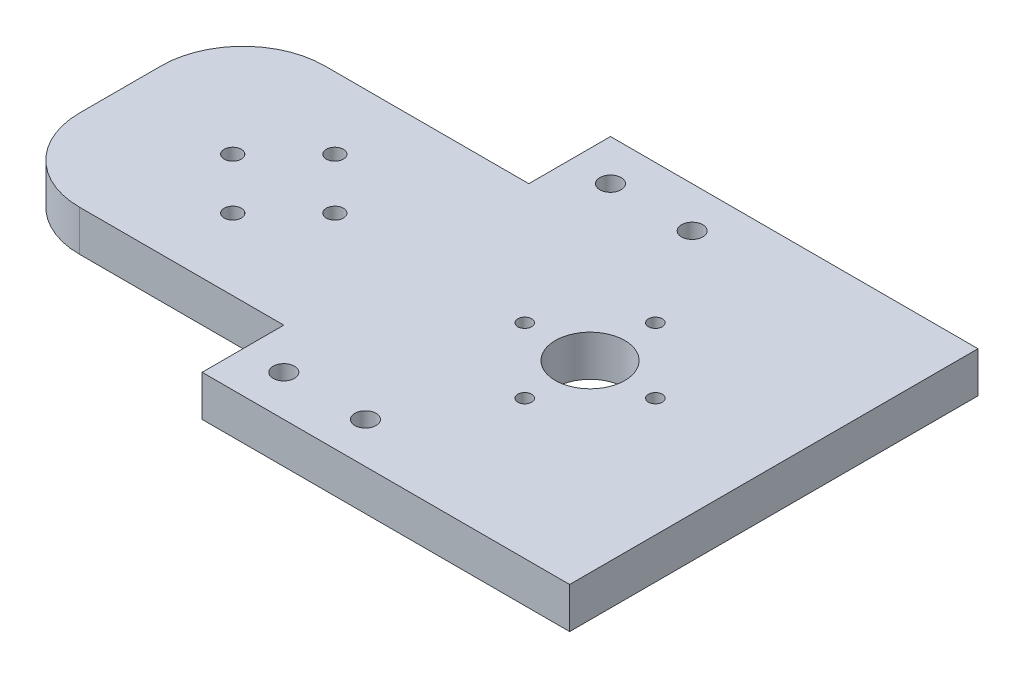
ISO-10303-21;
HEADER;
FILE_DESCRIPTION(('STEP AP214'),'2;1');
FILE_NAME('part.step','',(''),(''),'','','');
FILE_SCHEMA(('AUTOMOTIVE_DESIGN { 1 0 10303 214 1 1 1 1 }'));
ENDSEC;
DATA;
#1=APPLICATION_CONTEXT('core data for automotive mechanical design processes');
#2=APPLICATION_PROTOCOL_DEFINITION('international standard','automotive_design',2000,#1);
#3=PRODUCT_CONTEXT('',#1,'mechanical');
#4=PRODUCT('Part','Part','',(#3));
#5=PRODUCT_RELATED_PRODUCT_CATEGORY('part','',(#4));
#6=PRODUCT_DEFINITION_FORMATION('','',#4);
#7=PRODUCT_DEFINITION_CONTEXT('part definition',#1,'design');
#8=PRODUCT_DEFINITION('design','',#6,#7);
#9=PRODUCT_DEFINITION_SHAPE('','',#8);
#10=(LENGTH_UNIT() NAMED_UNIT(*) SI_UNIT(.MILLI.,.METRE.));
#11=(NAMED_UNIT(*) PLANE_ANGLE_UNIT() SI_UNIT($,.RADIAN.));
#12=(NAMED_UNIT(*) SI_UNIT($,.STERADIAN.) SOLID_ANGLE_UNIT());
#13=UNCERTAINTY_MEASURE_WITH_UNIT(LENGTH_MEASURE(1.E-05),#10,'distance_accuracy_value','');
#14=(GEOMETRIC_REPRESENTATION_CONTEXT(3) GLOBAL_UNCERTAINTY_ASSIGNED_CONTEXT((#13)) GLOBAL_UNIT_ASSIGNED_CONTEXT((#10,
#11,#12)) REPRESENTATION_CONTEXT('',''));
#15=CARTESIAN_POINT('',(0.,0.,0.));
#16=DIRECTION('',(0.,0.,1.));
#17=DIRECTION('',(1.,0.,0.));
#18=AXIS2_PLACEMENT_3D('',#15,#16,#17);
#19=CARTESIAN_POINT('',(-90.,10.,-50.));
#20=DIRECTION('',(0.,0.,1.));
#21=DIRECTION('',(1.,0.,0.));
#22=AXIS2_PLACEMENT_3D('',#19,#20,#21);
#23=PLANE('',#22);
#24=DIRECTION('',(-1.,0.,0.));
#25=VECTOR('',#24,1.);
#26=CARTESIAN_POINT('',(-90.,0.,-50.));
#27=LINE('',#26,#25);
#28=CARTESIAN_POINT('',(0.,0.,-50.));
#29=VERTEX_POINT('',#28);
#30=CARTESIAN_POINT('',(-90.,0.,-50.));
#31=VERTEX_POINT('',#30);
#32=EDGE_CURVE('E144',#29,#31,#27,.T.);
#33=ORIENTED_EDGE('',*,*,#32,.T.);
#34=DIRECTION('',(0.,-1.,0.));
#35=VECTOR('',#34,1.);
#36=CARTESIAN_POINT('',(-90.,10.,-50.));
#37=LINE('',#36,#35);
#38=CARTESIAN_POINT('',(-90.,10.,-50.));
#39=VERTEX_POINT('',#38);
#40=EDGE_CURVE('E127',#39,#31,#37,.T.);
#41=ORIENTED_EDGE('',*,*,#40,.F.);
#42=DIRECTION('',(-1.,0.,0.));
#43=VECTOR('',#42,1.);
#44=CARTESIAN_POINT('',(-90.,10.,-50.));
#45=LINE('',#44,#43);
#46=CARTESIAN_POINT('',(0.,10.,-50.));
#47=VERTEX_POINT('',#46);
#48=EDGE_CURVE('E135',#47,#39,#45,.T.);
#49=ORIENTED_EDGE('',*,*,#48,.F.);
#50=DIRECTION('',(0.,-1.,0.));
#51=VECTOR('',#50,1.);
#52=CARTESIAN_POINT('',(0.,10.,-50.));
#53=LINE('',#52,#51);
#54=EDGE_CURVE('E200',#47,#29,#53,.T.);
#55=ORIENTED_EDGE('',*,*,#54,.T.);
#56=EDGE_LOOP('',(#33,#41,#49,#55));
#57=FACE_BOUND('',#56,.T.);
#58=ADVANCED_FACE('F43',(#57),#23,.F.);
#59=CARTESIAN_POINT('',(-90.,10.,-30.));
#60=DIRECTION('',(1.,0.,0.));
#61=DIRECTION('',(0.,0.,-1.));
#62=AXIS2_PLACEMENT_3D('',#59,#60,#61);
#63=PLANE('',#62);
#64=DIRECTION('',(0.,0.,1.));
#65=VECTOR('',#64,1.);
#66=CARTESIAN_POINT('',(-90.,0.,-30.));
#67=LINE('',#66,#65);
#68=CARTESIAN_POINT('',(-90.,0.,-30.));
#69=VERTEX_POINT('',#68);
#70=EDGE_CURVE('E186',#31,#69,#67,.T.);
#71=ORIENTED_EDGE('',*,*,#70,.T.);
#72=DIRECTION('',(0.,-1.,0.));
#73=VECTOR('',#72,1.);
#74=CARTESIAN_POINT('',(-90.,10.,-30.));
#75=LINE('',#74,#73);
#76=CARTESIAN_POINT('',(-90.,10.,-30.));
#77=VERTEX_POINT('',#76);
#78=EDGE_CURVE('E129',#77,#69,#75,.T.);
#79=ORIENTED_EDGE('',*,*,#78,.F.);
#80=DIRECTION('',(0.,0.,1.));
#81=VECTOR('',#80,1.);
#82=CARTESIAN_POINT('',(-90.,10.,-30.));
#83=LINE('',#82,#81);
#84=EDGE_CURVE('E125',#39,#77,#83,.T.);
#85=ORIENTED_EDGE('',*,*,#84,.F.);
#86=ORIENTED_EDGE('',*,*,#40,.T.);
#87=EDGE_LOOP('',(#71,#79,#85,#86));
#88=FACE_BOUND('',#87,.T.);
#89=ADVANCED_FACE('F121',(#88),#63,.F.);
#90=CARTESIAN_POINT('',(-160.,10.,-30.));
#91=DIRECTION('',(0.,0.,1.));
#92=DIRECTION('',(1.,0.,0.));
#93=AXIS2_PLACEMENT_3D('',#90,#91,#92);
#94=PLANE('',#93);
#95=DIRECTION('',(-1.,0.,0.));
#96=VECTOR('',#95,1.);
#97=CARTESIAN_POINT('',(-160.,0.,-30.));
#98=LINE('',#97,#96);
#99=CARTESIAN_POINT('',(-140.,0.,-30.));
#100=VERTEX_POINT('',#99);
#101=EDGE_CURVE('E184',#69,#100,#98,.T.);
#102=ORIENTED_EDGE('',*,*,#101,.T.);
#103=DIRECTION('',(0.,-1.,0.));
#104=VECTOR('',#103,1.);
#105=CARTESIAN_POINT('',(-140.,10.,-30.));
#106=LINE('',#105,#104);
#107=CARTESIAN_POINT('',(-140.,10.,-30.));
#108=VERTEX_POINT('',#107);
#109=EDGE_CURVE('E11',#100,#108,#106,.F.);
#110=ORIENTED_EDGE('',*,*,#109,.T.);
#111=DIRECTION('',(-1.,0.,0.));
#112=VECTOR('',#111,1.);
#113=CARTESIAN_POINT('',(-160.,10.,-30.));
#114=LINE('',#113,#112);
#115=EDGE_CURVE('E132',#77,#108,#114,.T.);
#116=ORIENTED_EDGE('',*,*,#115,.F.);
#117=ORIENTED_EDGE('',*,*,#78,.T.);
#118=EDGE_LOOP('',(#102,#110,#116,#117));
#119=FACE_BOUND('',#118,.T.);
#120=ADVANCED_FACE('F222',(#119),#94,.F.);
#121=CARTESIAN_POINT('',(-160.,10.,30.));
#122=DIRECTION('',(1.,0.,0.));
#123=DIRECTION('',(0.,0.,-1.));
#124=AXIS2_PLACEMENT_3D('',#121,#122,#123);
#125=PLANE('',#124);
#126=DIRECTION('',(0.,0.,1.));
#127=VECTOR('',#126,1.);
#128=CARTESIAN_POINT('',(-160.,0.,30.));
#129=LINE('',#128,#127);
#130=CARTESIAN_POINT('',(-160.,0.,-10.));
#131=VERTEX_POINT('',#130);
#132=CARTESIAN_POINT('',(-160.,0.,10.));
#133=VERTEX_POINT('',#132);
#134=EDGE_CURVE('E179',#131,#133,#129,.T.);
#135=ORIENTED_EDGE('',*,*,#134,.T.);
#136=DIRECTION('',(0.,-1.,0.));
#137=VECTOR('',#136,1.);
#138=CARTESIAN_POINT('',(-160.,10.,10.));
#139=LINE('',#138,#137);
#140=CARTESIAN_POINT('',(-160.,10.,10.));
#141=VERTEX_POINT('',#140);
#142=EDGE_CURVE('E64',#133,#141,#139,.F.);
#143=ORIENTED_EDGE('',*,*,#142,.T.);
#144=DIRECTION('',(0.,0.,1.));
#145=VECTOR('',#144,1.);
#146=CARTESIAN_POINT('',(-160.,10.,30.));
#147=LINE('',#146,#145);
#148=CARTESIAN_POINT('',(-160.,10.,-10.));
#149=VERTEX_POINT('',#148);
#150=EDGE_CURVE('E168',#149,#141,#147,.T.);
#151=ORIENTED_EDGE('',*,*,#150,.F.);
#152=DIRECTION('',(0.,-1.,0.));
#153=VECTOR('',#152,1.);
#154=CARTESIAN_POINT('',(-160.,10.,-10.));
#155=LINE('',#154,#153);
#156=EDGE_CURVE('E157',#149,#131,#155,.T.);
#157=ORIENTED_EDGE('',*,*,#156,.T.);
#158=EDGE_LOOP('',(#135,#143,#151,#157));
#159=FACE_BOUND('',#158,.T.);
#160=ADVANCED_FACE('F182',(#159),#125,.F.);
#161=CARTESIAN_POINT('',(-90.,10.,30.));
#162=DIRECTION('',(0.,0.,-1.));
#163=DIRECTION('',(-1.,0.,0.));
#164=AXIS2_PLACEMENT_3D('',#161,#162,#163);
#165=PLANE('',#164);
#166=DIRECTION('',(1.,0.,0.));
#167=VECTOR('',#166,1.);
#168=CARTESIAN_POINT('',(-90.,10.,30.));
#169=LINE('',#168,#167);
#170=CARTESIAN_POINT('',(-140.,10.,30.));
#171=VERTEX_POINT('',#170);
#172=CARTESIAN_POINT('',(-90.,10.,30.));
#173=VERTEX_POINT('',#172);
#174=EDGE_CURVE('E165',#171,#173,#169,.T.);
#175=ORIENTED_EDGE('',*,*,#174,.F.);
#176=DIRECTION('',(0.,-1.,0.));
#177=VECTOR('',#176,1.);
#178=CARTESIAN_POINT('',(-140.,10.,30.));
#179=LINE('',#178,#177);
#180=CARTESIAN_POINT('',(-140.,0.,30.));
#181=VERTEX_POINT('',#180);
#182=EDGE_CURVE('E143',#171,#181,#179,.T.);
#183=ORIENTED_EDGE('',*,*,#182,.T.);
#184=DIRECTION('',(1.,0.,0.));
#185=VECTOR('',#184,1.);
#186=CARTESIAN_POINT('',(-90.,0.,30.));
#187=LINE('',#186,#185);
#188=CARTESIAN_POINT('',(-90.,0.,30.));
#189=VERTEX_POINT('',#188);
#190=EDGE_CURVE('E185',#181,#189,#187,.T.);
#191=ORIENTED_EDGE('',*,*,#190,.T.);
#192=DIRECTION('',(0.,-1.,0.));
#193=VECTOR('',#192,1.);
#194=CARTESIAN_POINT('',(-90.,10.,30.));
#195=LINE('',#194,#193);
#196=EDGE_CURVE('E146',#173,#189,#195,.T.);
#197=ORIENTED_EDGE('',*,*,#196,.F.);
#198=EDGE_LOOP('',(#175,#183,#191,#197));
#199=FACE_BOUND('',#198,.T.);
#200=ADVANCED_FACE('F167',(#199),#165,.F.);
#201=CARTESIAN_POINT('',(-90.,10.,50.));
#202=DIRECTION('',(1.,0.,0.));
#203=DIRECTION('',(0.,0.,-1.));
#204=AXIS2_PLACEMENT_3D('',#201,#202,#203);
#205=PLANE('',#204);
#206=DIRECTION('',(0.,0.,1.));
#207=VECTOR('',#206,1.);
#208=CARTESIAN_POINT('',(-90.,0.,50.));
#209=LINE('',#208,#207);
#210=CARTESIAN_POINT('',(-90.,0.,50.));
#211=VERTEX_POINT('',#210);
#212=EDGE_CURVE('E190',#189,#211,#209,.T.);
#213=ORIENTED_EDGE('',*,*,#212,.T.);
#214=DIRECTION('',(0.,-1.,0.));
#215=VECTOR('',#214,1.);
#216=CARTESIAN_POINT('',(-90.,10.,50.));
#217=LINE('',#216,#215);
#218=CARTESIAN_POINT('',(-90.,10.,50.));
#219=VERTEX_POINT('',#218);
#220=EDGE_CURVE('E202',#219,#211,#217,.T.);
#221=ORIENTED_EDGE('',*,*,#220,.F.);
#222=DIRECTION('',(0.,0.,1.));
#223=VECTOR('',#222,1.);
#224=CARTESIAN_POINT('',(-90.,10.,50.));
#225=LINE('',#224,#223);
#226=EDGE_CURVE('E172',#173,#219,#225,.T.);
#227=ORIENTED_EDGE('',*,*,#226,.F.);
#228=ORIENTED_EDGE('',*,*,#196,.T.);
#229=EDGE_LOOP('',(#213,#221,#227,#228));
#230=FACE_BOUND('',#229,.T.);
#231=ADVANCED_FACE('F205',(#230),#205,.F.);
#232=CARTESIAN_POINT('',(0.,10.,50.));
#233=DIRECTION('',(0.,0.,-1.));
#234=DIRECTION('',(-1.,0.,0.));
#235=AXIS2_PLACEMENT_3D('',#232,#233,#234);
#236=PLANE('',#235);
#237=DIRECTION('',(1.,0.,0.));
#238=VECTOR('',#237,1.);
#239=CARTESIAN_POINT('',(0.,0.,50.));
#240=LINE('',#239,#238);
#241=CARTESIAN_POINT('',(0.,0.,50.));
#242=VERTEX_POINT('',#241);
#243=EDGE_CURVE('E194',#211,#242,#240,.T.);
#244=ORIENTED_EDGE('',*,*,#243,.T.);
#245=DIRECTION('',(0.,-1.,0.));
#246=VECTOR('',#245,1.);
#247=CARTESIAN_POINT('',(0.,10.,50.));
#248=LINE('',#247,#246);
#249=CARTESIAN_POINT('',(0.,10.,50.));
#250=VERTEX_POINT('',#249);
#251=EDGE_CURVE('E196',#250,#242,#248,.T.);
#252=ORIENTED_EDGE('',*,*,#251,.F.);
#253=DIRECTION('',(1.,0.,0.));
#254=VECTOR('',#253,1.);
#255=CARTESIAN_POINT('',(0.,10.,50.));
#256=LINE('',#255,#254);
#257=EDGE_CURVE('E211',#219,#250,#256,.T.);
#258=ORIENTED_EDGE('',*,*,#257,.F.);
#259=ORIENTED_EDGE('',*,*,#220,.T.);
#260=EDGE_LOOP('',(#244,#252,#258,#259));
#261=FACE_BOUND('',#260,.T.);
#262=ADVANCED_FACE('F212',(#261),#236,.F.);
#263=CARTESIAN_POINT('',(0.,10.,-50.));
#264=DIRECTION('',(-1.,0.,0.));
#265=DIRECTION('',(0.,0.,1.));
#266=AXIS2_PLACEMENT_3D('',#263,#264,#265);
#267=PLANE('',#266);
#268=DIRECTION('',(0.,0.,-1.));
#269=VECTOR('',#268,1.);
#270=CARTESIAN_POINT('',(0.,0.,-50.));
#271=LINE('',#270,#269);
#272=EDGE_CURVE('E142',#242,#29,#271,.T.);
#273=ORIENTED_EDGE('',*,*,#272,.T.);
#274=ORIENTED_EDGE('',*,*,#54,.F.);
#275=DIRECTION('',(0.,0.,-1.));
#276=VECTOR('',#275,1.);
#277=CARTESIAN_POINT('',(0.,10.,-50.));
#278=LINE('',#277,#276);
#279=EDGE_CURVE('E137',#250,#47,#278,.T.);
#280=ORIENTED_EDGE('',*,*,#279,.F.);
#281=ORIENTED_EDGE('',*,*,#251,.T.);
#282=EDGE_LOOP('',(#273,#274,#280,#281));
#283=FACE_BOUND('',#282,.T.);
#284=ADVANCED_FACE('F214',(#283),#267,.F.);
#285=CARTESIAN_POINT('',(0.,10.,0.));
#286=DIRECTION('',(0.,-1.,0.));
#287=DIRECTION('',(0.,0.,-1.));
#288=AXIS2_PLACEMENT_3D('',#285,#286,#287);
#289=PLANE('',#288);
#290=CARTESIAN_POINT('',(-120.,10.,12.5));
#291=DIRECTION('',(0.,-1.,0.));
#292=DIRECTION('',(0.,0.,-1.));
#293=AXIS2_PLACEMENT_3D('',#290,#291,#292);
#294=CIRCLE('',#293,2.1);
#295=CARTESIAN_POINT('',(-120.,10.,10.4));
#296=VERTEX_POINT('',#295);
#297=EDGE_CURVE('E265',#296,#296,#294,.T.);
#298=ORIENTED_EDGE('',*,*,#297,.T.);
#299=EDGE_LOOP('',(#298));
#300=FACE_BOUND('',#299,.T.);
#301=CARTESIAN_POINT('',(-132.5,10.,0.));
#302=DIRECTION('',(0.,-1.,0.));
#303=DIRECTION('',(0.,0.,-1.));
#304=AXIS2_PLACEMENT_3D('',#301,#302,#303);
#305=CIRCLE('',#304,2.09999999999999);
#306=CARTESIAN_POINT('',(-132.5,10.,-2.09999999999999));
#307=VERTEX_POINT('',#306);
#308=EDGE_CURVE('E295',#307,#307,#305,.T.);
#309=ORIENTED_EDGE('',*,*,#308,.T.);
#310=EDGE_LOOP('',(#309));
#311=FACE_BOUND('',#310,.T.);
#312=CARTESIAN_POINT('',(-120.,10.,-12.5));
#313=DIRECTION('',(0.,-1.,0.));
#314=DIRECTION('',(0.,0.,-1.));
#315=AXIS2_PLACEMENT_3D('',#312,#313,#314);
#316=CIRCLE('',#315,2.1);
#317=CARTESIAN_POINT('',(-120.,10.,-14.6));
#318=VERTEX_POINT('',#317);
#319=EDGE_CURVE('E289',#318,#318,#316,.T.);
#320=ORIENTED_EDGE('',*,*,#319,.T.);
#321=EDGE_LOOP('',(#320));
#322=FACE_BOUND('',#321,.T.);
#323=CARTESIAN_POINT('',(-107.5,10.,0.));
#324=DIRECTION('',(0.,-1.,0.));
#325=DIRECTION('',(0.,0.,-1.));
#326=AXIS2_PLACEMENT_3D('',#323,#324,#325);
#327=CIRCLE('',#326,2.1);
#328=CARTESIAN_POINT('',(-107.5,10.,-2.1));
#329=VERTEX_POINT('',#328);
#330=EDGE_CURVE('E285',#329,#329,#327,.T.);
#331=ORIENTED_EDGE('',*,*,#330,.T.);
#332=EDGE_LOOP('',(#331));
#333=FACE_BOUND('',#332,.T.);
#334=CARTESIAN_POINT('',(-44.9999999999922,10.,16.0000000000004));
#335=DIRECTION('',(0.,-1.,0.));
#336=DIRECTION('',(0.,0.,-1.));
#337=AXIS2_PLACEMENT_3D('',#334,#335,#336);
#338=CIRCLE('',#337,1.7);
#339=CARTESIAN_POINT('',(-44.9999999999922,10.,14.3000000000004));
#340=VERTEX_POINT('',#339);
#341=EDGE_CURVE('E253',#340,#340,#338,.T.);
#342=ORIENTED_EDGE('',*,*,#341,.T.);
#343=EDGE_LOOP('',(#342));
#344=FACE_BOUND('',#343,.T.);
#345=CARTESIAN_POINT('',(-44.9999999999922,10.,-15.9999999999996));
#346=DIRECTION('',(0.,-1.,0.));
#347=DIRECTION('',(0.,0.,-1.));
#348=AXIS2_PLACEMENT_3D('',#345,#346,#347);
#349=CIRCLE('',#348,1.7);
#350=CARTESIAN_POINT('',(-44.9999999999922,10.,-17.6999999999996));
#351=VERTEX_POINT('',#350);
#352=EDGE_CURVE('E272',#351,#351,#349,.T.);
#353=ORIENTED_EDGE('',*,*,#352,.T.);
#354=EDGE_LOOP('',(#353));
#355=FACE_BOUND('',#354,.T.);
#356=CARTESIAN_POINT('',(-28.9999999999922,10.,0.));
#357=DIRECTION('',(0.,-1.,0.));
#358=DIRECTION('',(0.,0.,-1.));
#359=AXIS2_PLACEMENT_3D('',#356,#357,#358);
#360=CIRCLE('',#359,1.7);
#361=CARTESIAN_POINT('',(-28.9999999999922,10.,-1.7));
#362=VERTEX_POINT('',#361);
#363=EDGE_CURVE('E263',#362,#362,#360,.T.);
#364=ORIENTED_EDGE('',*,*,#363,.T.);
#365=EDGE_LOOP('',(#364));
#366=FACE_BOUND('',#365,.T.);
#367=CARTESIAN_POINT('',(-60.9999999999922,10.,0.));
#368=DIRECTION('',(0.,-1.,0.));
#369=DIRECTION('',(0.,0.,1.));
#370=AXIS2_PLACEMENT_3D('',#367,#368,#369);
#371=CIRCLE('',#370,1.7);
#372=CARTESIAN_POINT('',(-60.9999999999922,10.,1.7));
#373=VERTEX_POINT('',#372);
#374=EDGE_CURVE('E258',#373,#373,#371,.T.);
#375=ORIENTED_EDGE('',*,*,#374,.T.);
#376=EDGE_LOOP('',(#375));
#377=FACE_BOUND('',#376,.T.);
#378=CARTESIAN_POINT('',(-44.9999999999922,10.,3.84349670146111E-13));
#379=DIRECTION('',(0.,-1.,0.));
#380=DIRECTION('',(0.,0.,-1.));
#381=AXIS2_PLACEMENT_3D('',#378,#379,#380);
#382=CIRCLE('',#381,8.49999999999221);
#383=CARTESIAN_POINT('',(-44.9999999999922,10.,-8.49999999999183));
#384=VERTEX_POINT('',#383);
#385=EDGE_CURVE('E238',#384,#384,#382,.T.);
#386=ORIENTED_EDGE('',*,*,#385,.T.);
#387=EDGE_LOOP('',(#386));
#388=FACE_BOUND('',#387,.T.);
#389=CARTESIAN_POINT('',(-60.,10.,-40.));
#390=DIRECTION('',(0.,1.,0.));
#391=DIRECTION('',(0.,0.,1.));
#392=AXIS2_PLACEMENT_3D('',#389,#390,#391);
#393=CIRCLE('',#392,2.6);
#394=CARTESIAN_POINT('',(-60.,10.,-37.4));
#395=VERTEX_POINT('',#394);
#396=EDGE_CURVE('E240',#395,#395,#393,.T.);
#397=ORIENTED_EDGE('',*,*,#396,.F.);
#398=EDGE_LOOP('',(#397));
#399=FACE_BOUND('',#398,.T.);
#400=CARTESIAN_POINT('',(-80.,10.,-40.));
#401=DIRECTION('',(0.,1.,0.));
#402=DIRECTION('',(0.,0.,1.));
#403=AXIS2_PLACEMENT_3D('',#400,#401,#402);
#404=CIRCLE('',#403,2.6);
#405=CARTESIAN_POINT('',(-80.,10.,-37.4));
#406=VERTEX_POINT('',#405);
#407=EDGE_CURVE('E242',#406,#406,#404,.T.);
#408=ORIENTED_EDGE('',*,*,#407,.F.);
#409=EDGE_LOOP('',(#408));
#410=FACE_BOUND('',#409,.T.);
#411=CARTESIAN_POINT('',(-80.,10.,40.));
#412=DIRECTION('',(0.,1.,0.));
#413=DIRECTION('',(0.,0.,1.));
#414=AXIS2_PLACEMENT_3D('',#411,#412,#413);
#415=CIRCLE('',#414,2.6);
#416=CARTESIAN_POINT('',(-80.,10.,42.6));
#417=VERTEX_POINT('',#416);
#418=EDGE_CURVE('E233',#417,#417,#415,.T.);
#419=ORIENTED_EDGE('',*,*,#418,.F.);
#420=EDGE_LOOP('',(#419));
#421=FACE_BOUND('',#420,.T.);
#422=CARTESIAN_POINT('',(-60.,10.,40.));
#423=DIRECTION('',(0.,1.,0.));
#424=DIRECTION('',(0.,0.,1.));
#425=AXIS2_PLACEMENT_3D('',#422,#423,#424);
#426=CIRCLE('',#425,2.6);
#427=CARTESIAN_POINT('',(-60.,10.,42.6));
#428=VERTEX_POINT('',#427);
#429=EDGE_CURVE('E226',#428,#428,#426,.T.);
#430=ORIENTED_EDGE('',*,*,#429,.F.);
#431=EDGE_LOOP('',(#430));
#432=FACE_BOUND('',#431,.T.);
#433=ORIENTED_EDGE('',*,*,#150,.T.);
#434=CARTESIAN_POINT('',(-140.,10.,10.));
#435=DIRECTION('',(0.,-1.,0.));
#436=DIRECTION('',(0.,0.,-1.));
#437=AXIS2_PLACEMENT_3D('',#434,#435,#436);
#438=CIRCLE('',#437,20.);
#439=EDGE_CURVE('E51',#141,#171,#438,.F.);
#440=ORIENTED_EDGE('',*,*,#439,.T.);
#441=ORIENTED_EDGE('',*,*,#174,.T.);
#442=ORIENTED_EDGE('',*,*,#226,.T.);
#443=ORIENTED_EDGE('',*,*,#257,.T.);
#444=ORIENTED_EDGE('',*,*,#279,.T.);
#445=ORIENTED_EDGE('',*,*,#48,.T.);
#446=ORIENTED_EDGE('',*,*,#84,.T.);
#447=ORIENTED_EDGE('',*,*,#115,.T.);
#448=CARTESIAN_POINT('',(-140.,10.,-10.));
#449=DIRECTION('',(0.,-1.,0.));
#450=DIRECTION('',(0.,0.,-1.));
#451=AXIS2_PLACEMENT_3D('',#448,#449,#450);
#452=CIRCLE('',#451,20.);
#453=EDGE_CURVE('E163',#108,#149,#452,.F.);
#454=ORIENTED_EDGE('',*,*,#453,.T.);
#455=EDGE_LOOP('',(#433,#440,#441,#442,#443,#444,#445,#446,#447,#454));
#456=FACE_BOUND('',#455,.T.);
#457=ADVANCED_FACE('F133',(#300,#311,#322,#333,#344,#355,#366,#377,#388,#399,#410,#421,#432,
#456),#289,.F.);
#458=CARTESIAN_POINT('',(0.,0.,0.));
#459=DIRECTION('',(0.,-1.,0.));
#460=DIRECTION('',(0.,0.,-1.));
#461=AXIS2_PLACEMENT_3D('',#458,#459,#460);
#462=PLANE('',#461);
#463=CARTESIAN_POINT('',(-120.,0.,12.5));
#464=DIRECTION('',(0.,-1.,0.));
#465=DIRECTION('',(0.,0.,-1.));
#466=AXIS2_PLACEMENT_3D('',#463,#464,#465);
#467=CIRCLE('',#466,2.1);
#468=CARTESIAN_POINT('',(-120.,0.,10.4));
#469=VERTEX_POINT('',#468);
#470=EDGE_CURVE('E297',#469,#469,#467,.T.);
#471=ORIENTED_EDGE('',*,*,#470,.F.);
#472=EDGE_LOOP('',(#471));
#473=FACE_BOUND('',#472,.T.);
#474=CARTESIAN_POINT('',(-132.5,0.,0.));
#475=DIRECTION('',(0.,-1.,0.));
#476=DIRECTION('',(0.,0.,-1.));
#477=AXIS2_PLACEMENT_3D('',#474,#475,#476);
#478=CIRCLE('',#477,2.09999999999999);
#479=CARTESIAN_POINT('',(-132.5,0.,-2.09999999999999));
#480=VERTEX_POINT('',#479);
#481=EDGE_CURVE('E300',#480,#480,#478,.T.);
#482=ORIENTED_EDGE('',*,*,#481,.F.);
#483=EDGE_LOOP('',(#482));
#484=FACE_BOUND('',#483,.T.);
#485=CARTESIAN_POINT('',(-120.,0.,-12.5));
#486=DIRECTION('',(0.,-1.,0.));
#487=DIRECTION('',(0.,0.,-1.));
#488=AXIS2_PLACEMENT_3D('',#485,#486,#487);
#489=CIRCLE('',#488,2.1);
#490=CARTESIAN_POINT('',(-120.,0.,-14.6));
#491=VERTEX_POINT('',#490);
#492=EDGE_CURVE('E293',#491,#491,#489,.T.);
#493=ORIENTED_EDGE('',*,*,#492,.F.);
#494=EDGE_LOOP('',(#493));
#495=FACE_BOUND('',#494,.T.);
#496=CARTESIAN_POINT('',(-107.5,0.,0.));
#497=DIRECTION('',(0.,-1.,0.));
#498=DIRECTION('',(0.,0.,-1.));
#499=AXIS2_PLACEMENT_3D('',#496,#497,#498);
#500=CIRCLE('',#499,2.1);
#501=CARTESIAN_POINT('',(-107.5,0.,-2.1));
#502=VERTEX_POINT('',#501);
#503=EDGE_CURVE('E283',#502,#502,#500,.T.);
#504=ORIENTED_EDGE('',*,*,#503,.F.);
#505=EDGE_LOOP('',(#504));
#506=FACE_BOUND('',#505,.T.);
#507=CARTESIAN_POINT('',(-44.9999999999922,0.,16.0000000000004));
#508=DIRECTION('',(0.,-1.,0.));
#509=DIRECTION('',(0.,0.,-1.));
#510=AXIS2_PLACEMENT_3D('',#507,#508,#509);
#511=CIRCLE('',#510,1.7);
#512=CARTESIAN_POINT('',(-44.9999999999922,0.,14.3000000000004));
#513=VERTEX_POINT('',#512);
#514=EDGE_CURVE('E280',#513,#513,#511,.T.);
#515=ORIENTED_EDGE('',*,*,#514,.F.);
#516=EDGE_LOOP('',(#515));
#517=FACE_BOUND('',#516,.T.);
#518=CARTESIAN_POINT('',(-44.9999999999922,0.,-15.9999999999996));
#519=DIRECTION('',(0.,-1.,0.));
#520=DIRECTION('',(0.,0.,-1.));
#521=AXIS2_PLACEMENT_3D('',#518,#519,#520);
#522=CIRCLE('',#521,1.7);
#523=CARTESIAN_POINT('',(-44.9999999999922,0.,-17.6999999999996));
#524=VERTEX_POINT('',#523);
#525=EDGE_CURVE('E274',#524,#524,#522,.T.);
#526=ORIENTED_EDGE('',*,*,#525,.F.);
#527=EDGE_LOOP('',(#526));
#528=FACE_BOUND('',#527,.T.);
#529=CARTESIAN_POINT('',(-28.9999999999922,0.,0.));
#530=DIRECTION('',(0.,-1.,0.));
#531=DIRECTION('',(0.,0.,-1.));
#532=AXIS2_PLACEMENT_3D('',#529,#530,#531);
#533=CIRCLE('',#532,1.7);
#534=CARTESIAN_POINT('',(-28.9999999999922,0.,-1.7));
#535=VERTEX_POINT('',#534);
#536=EDGE_CURVE('E269',#535,#535,#533,.T.);
#537=ORIENTED_EDGE('',*,*,#536,.F.);
#538=EDGE_LOOP('',(#537));
#539=FACE_BOUND('',#538,.T.);
#540=CARTESIAN_POINT('',(-60.9999999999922,0.,0.));
#541=DIRECTION('',(0.,-1.,0.));
#542=DIRECTION('',(0.,0.,1.));
#543=AXIS2_PLACEMENT_3D('',#540,#541,#542);
#544=CIRCLE('',#543,1.7);
#545=CARTESIAN_POINT('',(-60.9999999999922,0.,1.7));
#546=VERTEX_POINT('',#545);
#547=EDGE_CURVE('E262',#546,#546,#544,.T.);
#548=ORIENTED_EDGE('',*,*,#547,.F.);
#549=EDGE_LOOP('',(#548));
#550=FACE_BOUND('',#549,.T.);
#551=CARTESIAN_POINT('',(-44.9999999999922,0.,3.84349670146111E-13));
#552=DIRECTION('',(0.,-1.,0.));
#553=DIRECTION('',(0.,0.,-1.));
#554=AXIS2_PLACEMENT_3D('',#551,#552,#553);
#555=CIRCLE('',#554,8.49999999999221);
#556=CARTESIAN_POINT('',(-44.9999999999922,0.,-8.49999999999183));
#557=VERTEX_POINT('',#556);
#558=EDGE_CURVE('E255',#557,#557,#555,.T.);
#559=ORIENTED_EDGE('',*,*,#558,.F.);
#560=EDGE_LOOP('',(#559));
#561=FACE_BOUND('',#560,.T.);
#562=CARTESIAN_POINT('',(-60.,0.,-40.));
#563=DIRECTION('',(0.,1.,0.));
#564=DIRECTION('',(0.,0.,1.));
#565=AXIS2_PLACEMENT_3D('',#562,#563,#564);
#566=CIRCLE('',#565,2.6);
#567=CARTESIAN_POINT('',(-60.,0.,-37.4));
#568=VERTEX_POINT('',#567);
#569=EDGE_CURVE('E234',#568,#568,#566,.T.);
#570=ORIENTED_EDGE('',*,*,#569,.T.);
#571=EDGE_LOOP('',(#570));
#572=FACE_BOUND('',#571,.T.);
#573=CARTESIAN_POINT('',(-80.,0.,-40.));
#574=DIRECTION('',(0.,1.,0.));
#575=DIRECTION('',(0.,0.,1.));
#576=AXIS2_PLACEMENT_3D('',#573,#574,#575);
#577=CIRCLE('',#576,2.6);
#578=CARTESIAN_POINT('',(-80.,0.,-37.4));
#579=VERTEX_POINT('',#578);
#580=EDGE_CURVE('E241',#579,#579,#577,.T.);
#581=ORIENTED_EDGE('',*,*,#580,.T.);
#582=EDGE_LOOP('',(#581));
#583=FACE_BOUND('',#582,.T.);
#584=CARTESIAN_POINT('',(-80.,0.,40.));
#585=DIRECTION('',(0.,1.,0.));
#586=DIRECTION('',(0.,0.,1.));
#587=AXIS2_PLACEMENT_3D('',#584,#585,#586);
#588=CIRCLE('',#587,2.6);
#589=CARTESIAN_POINT('',(-80.,0.,42.6));
#590=VERTEX_POINT('',#589);
#591=EDGE_CURVE('E250',#590,#590,#588,.T.);
#592=ORIENTED_EDGE('',*,*,#591,.T.);
#593=EDGE_LOOP('',(#592));
#594=FACE_BOUND('',#593,.T.);
#595=CARTESIAN_POINT('',(-60.,0.,40.));
#596=DIRECTION('',(0.,1.,0.));
#597=DIRECTION('',(0.,0.,1.));
#598=AXIS2_PLACEMENT_3D('',#595,#596,#597);
#599=CIRCLE('',#598,2.6);
#600=CARTESIAN_POINT('',(-60.,0.,42.6));
#601=VERTEX_POINT('',#600);
#602=EDGE_CURVE('E218',#601,#601,#599,.T.);
#603=ORIENTED_EDGE('',*,*,#602,.T.);
#604=EDGE_LOOP('',(#603));
#605=FACE_BOUND('',#604,.T.);
#606=ORIENTED_EDGE('',*,*,#190,.F.);
#607=CARTESIAN_POINT('',(-140.,0.,10.));
#608=DIRECTION('',(0.,-1.,0.));
#609=DIRECTION('',(0.,0.,-1.));
#610=AXIS2_PLACEMENT_3D('',#607,#608,#609);
#611=CIRCLE('',#610,20.);
#612=EDGE_CURVE('E153',#181,#133,#611,.T.);
#613=ORIENTED_EDGE('',*,*,#612,.T.);
#614=ORIENTED_EDGE('',*,*,#134,.F.);
#615=CARTESIAN_POINT('',(-140.,0.,-10.));
#616=DIRECTION('',(0.,-1.,0.));
#617=DIRECTION('',(0.,0.,-1.));
#618=AXIS2_PLACEMENT_3D('',#615,#616,#617);
#619=CIRCLE('',#618,20.);
#620=EDGE_CURVE('E148',#131,#100,#619,.T.);
#621=ORIENTED_EDGE('',*,*,#620,.T.);
#622=ORIENTED_EDGE('',*,*,#101,.F.);
#623=ORIENTED_EDGE('',*,*,#70,.F.);
#624=ORIENTED_EDGE('',*,*,#32,.F.);
#625=ORIENTED_EDGE('',*,*,#272,.F.);
#626=ORIENTED_EDGE('',*,*,#243,.F.);
#627=ORIENTED_EDGE('',*,*,#212,.F.);
#628=EDGE_LOOP('',(#606,#613,#614,#621,#622,#623,#624,#625,#626,#627));
#629=FACE_BOUND('',#628,.T.);
#630=ADVANCED_FACE('F177',(#473,#484,#495,#506,#517,#528,#539,#550,#561,#572,#583,#594,#605,
#629),#462,.T.);
#631=CARTESIAN_POINT('',(-140.,10.,10.));
#632=DIRECTION('',(0.,-1.,0.));
#633=DIRECTION('',(0.,0.,-1.));
#634=AXIS2_PLACEMENT_3D('',#631,#632,#633);
#635=CYLINDRICAL_SURFACE('',#634,20.);
#636=ORIENTED_EDGE('',*,*,#439,.F.);
#637=ORIENTED_EDGE('',*,*,#142,.F.);
#638=ORIENTED_EDGE('',*,*,#612,.F.);
#639=ORIENTED_EDGE('',*,*,#182,.F.);
#640=EDGE_LOOP('',(#636,#637,#638,#639));
#641=FACE_BOUND('',#640,.T.);
#642=ADVANCED_FACE('F176',(#641),#635,.T.);
#643=CARTESIAN_POINT('',(-140.,10.,-10.));
#644=DIRECTION('',(0.,-1.,0.));
#645=DIRECTION('',(0.,0.,-1.));
#646=AXIS2_PLACEMENT_3D('',#643,#644,#645);
#647=CYLINDRICAL_SURFACE('',#646,20.);
#648=ORIENTED_EDGE('',*,*,#453,.F.);
#649=ORIENTED_EDGE('',*,*,#109,.F.);
#650=ORIENTED_EDGE('',*,*,#620,.F.);
#651=ORIENTED_EDGE('',*,*,#156,.F.);
#652=EDGE_LOOP('',(#648,#649,#650,#651));
#653=FACE_BOUND('',#652,.T.);
#654=ADVANCED_FACE('F44',(#653),#647,.T.);
#655=CARTESIAN_POINT('',(-60.,0.,40.));
#656=DIRECTION('',(0.,1.,0.));
#657=DIRECTION('',(0.,0.,1.));
#658=AXIS2_PLACEMENT_3D('',#655,#656,#657);
#659=CYLINDRICAL_SURFACE('',#658,2.6);
#660=ORIENTED_EDGE('',*,*,#602,.F.);
#661=EDGE_LOOP('',(#660));
#662=FACE_BOUND('',#661,.T.);
#663=ORIENTED_EDGE('',*,*,#429,.T.);
#664=EDGE_LOOP('',(#663));
#665=FACE_BOUND('',#664,.T.);
#666=ADVANCED_FACE('F345',(#662,#665),#659,.F.);
#667=CARTESIAN_POINT('',(-80.,0.,40.));
#668=DIRECTION('',(0.,1.,0.));
#669=DIRECTION('',(0.,0.,1.));
#670=AXIS2_PLACEMENT_3D('',#667,#668,#669);
#671=CYLINDRICAL_SURFACE('',#670,2.6);
#672=ORIENTED_EDGE('',*,*,#591,.F.);
#673=EDGE_LOOP('',(#672));
#674=FACE_BOUND('',#673,.T.);
#675=ORIENTED_EDGE('',*,*,#418,.T.);
#676=EDGE_LOOP('',(#675));
#677=FACE_BOUND('',#676,.T.);
#678=ADVANCED_FACE('F341',(#674,#677),#671,.F.);
#679=CARTESIAN_POINT('',(-80.,0.,-40.));
#680=DIRECTION('',(0.,1.,0.));
#681=DIRECTION('',(0.,0.,1.));
#682=AXIS2_PLACEMENT_3D('',#679,#680,#681);
#683=CYLINDRICAL_SURFACE('',#682,2.6);
#684=ORIENTED_EDGE('',*,*,#580,.F.);
#685=EDGE_LOOP('',(#684));
#686=FACE_BOUND('',#685,.T.);
#687=ORIENTED_EDGE('',*,*,#407,.T.);
#688=EDGE_LOOP('',(#687));
#689=FACE_BOUND('',#688,.T.);
#690=ADVANCED_FACE('F387',(#686,#689),#683,.F.);
#691=CARTESIAN_POINT('',(-60.,0.,-40.));
#692=DIRECTION('',(0.,1.,0.));
#693=DIRECTION('',(0.,0.,1.));
#694=AXIS2_PLACEMENT_3D('',#691,#692,#693);
#695=CYLINDRICAL_SURFACE('',#694,2.6);
#696=ORIENTED_EDGE('',*,*,#569,.F.);
#697=EDGE_LOOP('',(#696));
#698=FACE_BOUND('',#697,.T.);
#699=ORIENTED_EDGE('',*,*,#396,.T.);
#700=EDGE_LOOP('',(#699));
#701=FACE_BOUND('',#700,.T.);
#702=ADVANCED_FACE('F397',(#698,#701),#695,.F.);
#703=CARTESIAN_POINT('',(-44.9999999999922,10.,3.84349670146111E-13));
#704=DIRECTION('',(0.,-1.,0.));
#705=DIRECTION('',(0.,0.,-1.));
#706=AXIS2_PLACEMENT_3D('',#703,#704,#705);
#707=CYLINDRICAL_SURFACE('',#706,8.49999999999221);
#708=ORIENTED_EDGE('',*,*,#385,.F.);
#709=EDGE_LOOP('',(#708));
#710=FACE_BOUND('',#709,.T.);
#711=ORIENTED_EDGE('',*,*,#558,.T.);
#712=EDGE_LOOP('',(#711));
#713=FACE_BOUND('',#712,.T.);
#714=ADVANCED_FACE('F408',(#710,#713),#707,.F.);
#715=CARTESIAN_POINT('',(-60.9999999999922,10.,0.));
#716=DIRECTION('',(0.,-1.,0.));
#717=DIRECTION('',(0.,0.,-1.));
#718=AXIS2_PLACEMENT_3D('',#715,#716,#717);
#719=CYLINDRICAL_SURFACE('',#718,1.7);
#720=ORIENTED_EDGE('',*,*,#374,.F.);
#721=EDGE_LOOP('',(#720));
#722=FACE_BOUND('',#721,.T.);
#723=ORIENTED_EDGE('',*,*,#547,.T.);
#724=EDGE_LOOP('',(#723));
#725=FACE_BOUND('',#724,.T.);
#726=ADVANCED_FACE('F419',(#722,#725),#719,.F.);
#727=CARTESIAN_POINT('',(-28.9999999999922,10.,0.));
#728=DIRECTION('',(0.,-1.,0.));
#729=DIRECTION('',(0.,0.,-1.));
#730=AXIS2_PLACEMENT_3D('',#727,#728,#729);
#731=CYLINDRICAL_SURFACE('',#730,1.7);
#732=ORIENTED_EDGE('',*,*,#363,.F.);
#733=EDGE_LOOP('',(#732));
#734=FACE_BOUND('',#733,.T.);
#735=ORIENTED_EDGE('',*,*,#536,.T.);
#736=EDGE_LOOP('',(#735));
#737=FACE_BOUND('',#736,.T.);
#738=ADVANCED_FACE('F430',(#734,#737),#731,.F.);
#739=CARTESIAN_POINT('',(-44.9999999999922,10.,-15.9999999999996));
#740=DIRECTION('',(0.,-1.,0.));
#741=DIRECTION('',(0.,0.,-1.));
#742=AXIS2_PLACEMENT_3D('',#739,#740,#741);
#743=CYLINDRICAL_SURFACE('',#742,1.7);
#744=ORIENTED_EDGE('',*,*,#352,.F.);
#745=EDGE_LOOP('',(#744));
#746=FACE_BOUND('',#745,.T.);
#747=ORIENTED_EDGE('',*,*,#525,.T.);
#748=EDGE_LOOP('',(#747));
#749=FACE_BOUND('',#748,.T.);
#750=ADVANCED_FACE('F438',(#746,#749),#743,.F.);
#751=CARTESIAN_POINT('',(-44.9999999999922,10.,16.0000000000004));
#752=DIRECTION('',(0.,-1.,0.));
#753=DIRECTION('',(0.,0.,-1.));
#754=AXIS2_PLACEMENT_3D('',#751,#752,#753);
#755=CYLINDRICAL_SURFACE('',#754,1.7);
#756=ORIENTED_EDGE('',*,*,#341,.F.);
#757=EDGE_LOOP('',(#756));
#758=FACE_BOUND('',#757,.T.);
#759=ORIENTED_EDGE('',*,*,#514,.T.);
#760=EDGE_LOOP('',(#759));
#761=FACE_BOUND('',#760,.T.);
#762=ADVANCED_FACE('F446',(#758,#761),#755,.F.);
#763=CARTESIAN_POINT('',(-107.5,10.,0.));
#764=DIRECTION('',(0.,-1.,0.));
#765=DIRECTION('',(0.,0.,-1.));
#766=AXIS2_PLACEMENT_3D('',#763,#764,#765);
#767=CYLINDRICAL_SURFACE('',#766,2.1);
#768=ORIENTED_EDGE('',*,*,#330,.F.);
#769=EDGE_LOOP('',(#768));
#770=FACE_BOUND('',#769,.T.);
#771=ORIENTED_EDGE('',*,*,#503,.T.);
#772=EDGE_LOOP('',(#771));
#773=FACE_BOUND('',#772,.T.);
#774=ADVANCED_FACE('F456',(#770,#773),#767,.F.);
#775=CARTESIAN_POINT('',(-120.,10.,-12.5));
#776=DIRECTION('',(0.,-1.,0.));
#777=DIRECTION('',(0.,0.,-1.));
#778=AXIS2_PLACEMENT_3D('',#775,#776,#777);
#779=CYLINDRICAL_SURFACE('',#778,2.1);
#780=ORIENTED_EDGE('',*,*,#319,.F.);
#781=EDGE_LOOP('',(#780));
#782=FACE_BOUND('',#781,.T.);
#783=ORIENTED_EDGE('',*,*,#492,.T.);
#784=EDGE_LOOP('',(#783));
#785=FACE_BOUND('',#784,.T.);
#786=ADVANCED_FACE('F474',(#782,#785),#779,.F.);
#787=CARTESIAN_POINT('',(-132.5,10.,0.));
#788=DIRECTION('',(0.,-1.,0.));
#789=DIRECTION('',(0.,0.,-1.));
#790=AXIS2_PLACEMENT_3D('',#787,#788,#789);
#791=CYLINDRICAL_SURFACE('',#790,2.09999999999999);
#792=ORIENTED_EDGE('',*,*,#308,.F.);
#793=EDGE_LOOP('',(#792));
#794=FACE_BOUND('',#793,.T.);
#795=ORIENTED_EDGE('',*,*,#481,.T.);
#796=EDGE_LOOP('',(#795));
#797=FACE_BOUND('',#796,.T.);
#798=ADVANCED_FACE('F311',(#794,#797),#791,.F.);
#799=CARTESIAN_POINT('',(-120.,10.,12.5));
#800=DIRECTION('',(0.,-1.,0.));
#801=DIRECTION('',(0.,0.,-1.));
#802=AXIS2_PLACEMENT_3D('',#799,#800,#801);
#803=CYLINDRICAL_SURFACE('',#802,2.1);
#804=ORIENTED_EDGE('',*,*,#297,.F.);
#805=EDGE_LOOP('',(#804));
#806=FACE_BOUND('',#805,.T.);
#807=ORIENTED_EDGE('',*,*,#470,.T.);
#808=EDGE_LOOP('',(#807));
#809=FACE_BOUND('',#808,.T.);
#810=ADVANCED_FACE('F308',(#806,#809),#803,.F.);
#811=CLOSED_SHELL('',(#58,#89,#120,#160,#200,#231,#262,#284,#457,#630,#642,#654,#666,#678,#690,
#702,#714,#726,#738,#750,#762,#774,#786,#798,#810));
#812=MANIFOLD_SOLID_BREP('B2',#811);
#813=ADVANCED_BREP_SHAPE_REPRESENTATION('',(#18,#812),#14);
#814=SHAPE_DEFINITION_REPRESENTATION(#9,#813);
ENDSEC;
END-ISO-10303-21;
